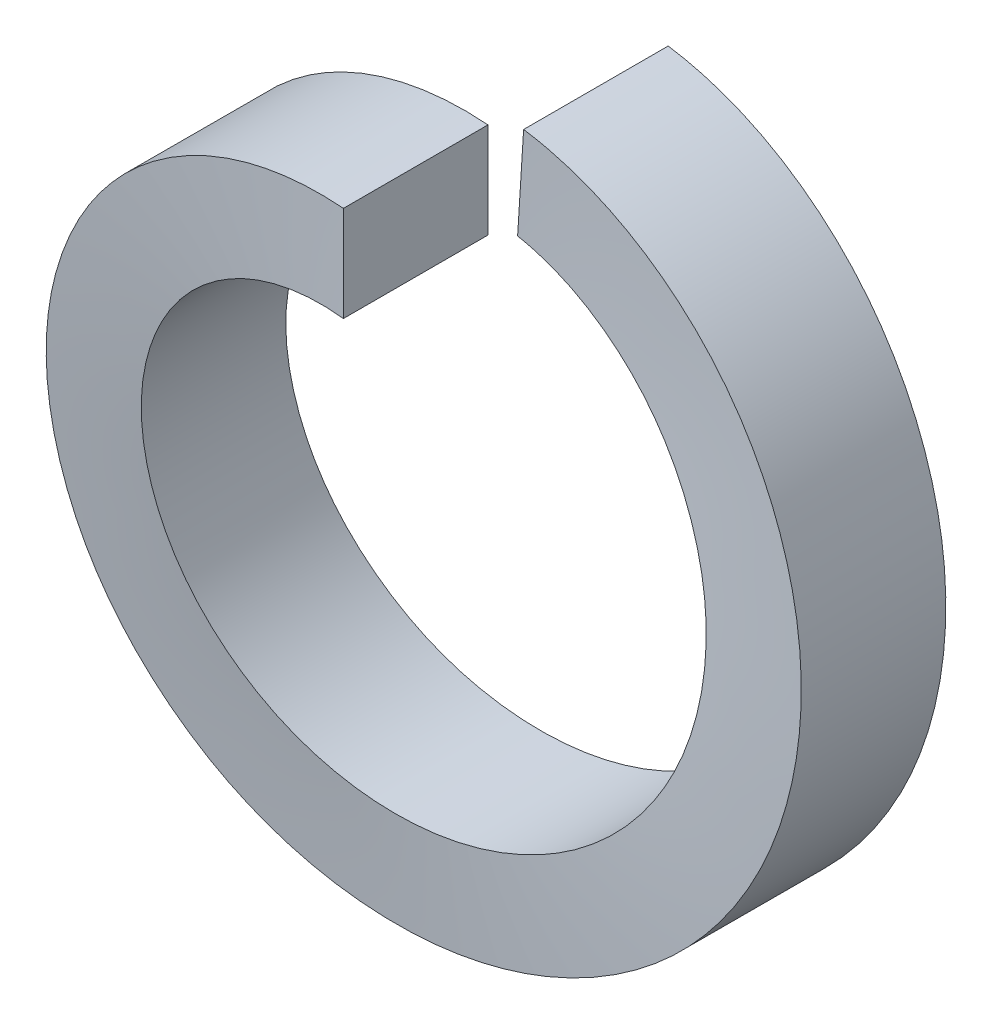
from build123d import *

# Parameters (mm, degrees)
SWEEP1_PITCH       = 2.201333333
SWEEP1_HEIGHT      = 2.17932
SWEEP1_RADIUS      = 4.6101
SWEEP1_START_ANGLE = 90
SKETCH2_W          = 1.9812
SKETCH2_H          = 1.3081


with BuildPart() as part:
    # Sweep1: sweep along a helix
    with BuildLine() as sweep1_path:
        add(Helix(SWEEP1_PITCH, SWEEP1_HEIGHT, SWEEP1_RADIUS, center=(0, 0, 0), direction=(0, 0, -1), lefthand=True, mode=Mode.PRIVATE).rotate(Axis((0, 0, 0), (0, 0, -1)), SWEEP1_START_ANGLE))
    # Sketch2 → Sweep1 (sweep)
    with BuildSketch(Plane(origin=(0, 0, 0), x_dir=(0, 0, -1), z_dir=(1, 0, 0))):
        with Locations((-0.9906, 3.95605)):
            Rectangle(SKETCH2_W, SKETCH2_H)
    sweep(path=sweep1_path.line, is_frenet=True)


solid = part.part
